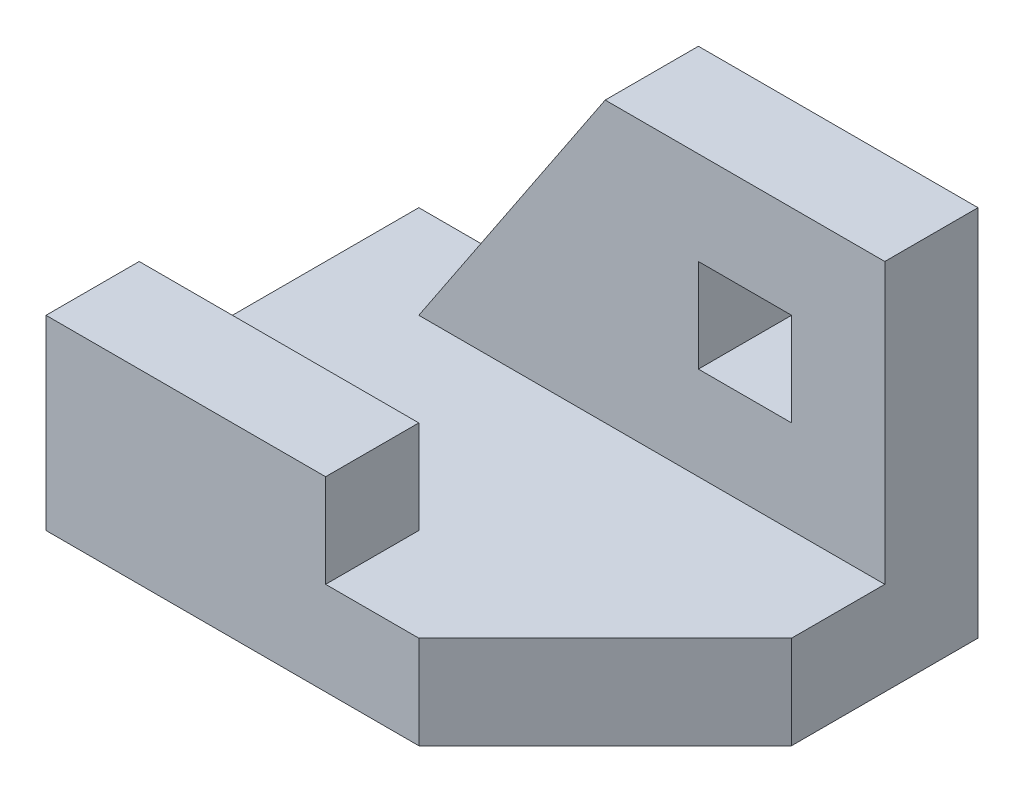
ISO-10303-21;
HEADER;
FILE_DESCRIPTION(('STEP AP214'),'2;1');
FILE_NAME('part.step','',(''),(''),'','','');
FILE_SCHEMA(('AUTOMOTIVE_DESIGN { 1 0 10303 214 1 1 1 1 }'));
ENDSEC;
DATA;
#1=APPLICATION_CONTEXT('core data for automotive mechanical design processes');
#2=APPLICATION_PROTOCOL_DEFINITION('international standard','automotive_design',2000,#1);
#3=PRODUCT_CONTEXT('',#1,'mechanical');
#4=PRODUCT('Part','Part','',(#3));
#5=PRODUCT_RELATED_PRODUCT_CATEGORY('part','',(#4));
#6=PRODUCT_DEFINITION_FORMATION('','',#4);
#7=PRODUCT_DEFINITION_CONTEXT('part definition',#1,'design');
#8=PRODUCT_DEFINITION('design','',#6,#7);
#9=PRODUCT_DEFINITION_SHAPE('','',#8);
#10=(LENGTH_UNIT() NAMED_UNIT(*) SI_UNIT(.MILLI.,.METRE.));
#11=(NAMED_UNIT(*) PLANE_ANGLE_UNIT() SI_UNIT($,.RADIAN.));
#12=(NAMED_UNIT(*) SI_UNIT($,.STERADIAN.) SOLID_ANGLE_UNIT());
#13=UNCERTAINTY_MEASURE_WITH_UNIT(LENGTH_MEASURE(1.E-05),#10,'distance_accuracy_value','');
#14=(GEOMETRIC_REPRESENTATION_CONTEXT(3) GLOBAL_UNCERTAINTY_ASSIGNED_CONTEXT((#13)) GLOBAL_UNIT_ASSIGNED_CONTEXT((#10,
#11,#12)) REPRESENTATION_CONTEXT('',''));
#15=CARTESIAN_POINT('',(0.,0.,0.));
#16=DIRECTION('',(0.,0.,1.));
#17=DIRECTION('',(1.,0.,0.));
#18=AXIS2_PLACEMENT_3D('',#15,#16,#17);
#19=CARTESIAN_POINT('',(-30.,10.,-20.));
#20=DIRECTION('',(0.,-1.,0.));
#21=DIRECTION('',(0.,0.,-1.));
#22=AXIS2_PLACEMENT_3D('',#19,#20,#21);
#23=PLANE('',#22);
#24=DIRECTION('',(-1.,0.,0.));
#25=VECTOR('',#24,1.);
#26=CARTESIAN_POINT('',(-20.,10.,-10.));
#27=LINE('',#26,#25);
#28=CARTESIAN_POINT('',(30.,10.,-10.));
#29=VERTEX_POINT('',#28);
#30=CARTESIAN_POINT('',(-20.,10.,-10.));
#31=VERTEX_POINT('',#30);
#32=EDGE_CURVE('E48',#29,#31,#27,.T.);
#33=ORIENTED_EDGE('',*,*,#32,.T.);
#34=DIRECTION('',(0.,0.,-1.));
#35=VECTOR('',#34,1.);
#36=CARTESIAN_POINT('',(-20.,10.,-10.));
#37=LINE('',#36,#35);
#38=CARTESIAN_POINT('',(-20.,10.,-20.));
#39=VERTEX_POINT('',#38);
#40=EDGE_CURVE('E193',#31,#39,#37,.T.);
#41=ORIENTED_EDGE('',*,*,#40,.T.);
#42=DIRECTION('',(-1.,0.,0.));
#43=VECTOR('',#42,1.);
#44=CARTESIAN_POINT('',(-30.,10.,-20.));
#45=LINE('',#44,#43);
#46=CARTESIAN_POINT('',(-30.,10.,-20.));
#47=VERTEX_POINT('',#46);
#48=EDGE_CURVE('E257',#39,#47,#45,.T.);
#49=ORIENTED_EDGE('',*,*,#48,.T.);
#50=DIRECTION('',(0.,0.,1.));
#51=VECTOR('',#50,1.);
#52=CARTESIAN_POINT('',(-30.,10.,20.));
#53=LINE('',#52,#51);
#54=CARTESIAN_POINT('',(-30.,10.,10.));
#55=VERTEX_POINT('',#54);
#56=EDGE_CURVE('E248',#47,#55,#53,.T.);
#57=ORIENTED_EDGE('',*,*,#56,.T.);
#58=DIRECTION('',(-1.,0.,0.));
#59=VECTOR('',#58,1.);
#60=CARTESIAN_POINT('',(-30.,10.,10.));
#61=LINE('',#60,#59);
#62=CARTESIAN_POINT('',(0.,10.,10.));
#63=VERTEX_POINT('',#62);
#64=EDGE_CURVE('E209',#63,#55,#61,.T.);
#65=ORIENTED_EDGE('',*,*,#64,.F.);
#66=DIRECTION('',(0.,0.,-1.));
#67=VECTOR('',#66,1.);
#68=CARTESIAN_POINT('',(0.,10.,20.));
#69=LINE('',#68,#67);
#70=CARTESIAN_POINT('',(0.,10.,20.));
#71=VERTEX_POINT('',#70);
#72=EDGE_CURVE('E201',#71,#63,#69,.T.);
#73=ORIENTED_EDGE('',*,*,#72,.F.);
#74=DIRECTION('',(1.,0.,0.));
#75=VECTOR('',#74,1.);
#76=CARTESIAN_POINT('',(-30.,10.,20.));
#77=LINE('',#76,#75);
#78=CARTESIAN_POINT('',(9.99999999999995,10.,20.));
#79=VERTEX_POINT('',#78);
#80=EDGE_CURVE('E250',#71,#79,#77,.T.);
#81=ORIENTED_EDGE('',*,*,#80,.T.);
#82=DIRECTION('',(-0.707106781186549,0.,0.707106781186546));
#83=VECTOR('',#82,1.);
#84=CARTESIAN_POINT('',(30.,10.,0.));
#85=LINE('',#84,#83);
#86=CARTESIAN_POINT('',(30.,10.,0.));
#87=VERTEX_POINT('',#86);
#88=EDGE_CURVE('E11',#79,#87,#85,.F.);
#89=ORIENTED_EDGE('',*,*,#88,.T.);
#90=DIRECTION('',(0.,0.,-1.));
#91=VECTOR('',#90,1.);
#92=CARTESIAN_POINT('',(30.,10.,20.));
#93=LINE('',#92,#91);
#94=EDGE_CURVE('E52',#87,#29,#93,.T.);
#95=ORIENTED_EDGE('',*,*,#94,.T.);
#96=EDGE_LOOP('',(#33,#41,#49,#57,#65,#73,#81,#89,#95));
#97=FACE_BOUND('',#96,.T.);
#98=ADVANCED_FACE('F31',(#97),#23,.F.);
#99=CARTESIAN_POINT('',(-30.,10.,20.));
#100=DIRECTION('',(1.,0.,0.));
#101=DIRECTION('',(0.,0.,-1.));
#102=AXIS2_PLACEMENT_3D('',#99,#100,#101);
#103=PLANE('',#102);
#104=DIRECTION('',(0.,0.,1.));
#105=VECTOR('',#104,1.);
#106=CARTESIAN_POINT('',(-30.,0.,20.));
#107=LINE('',#106,#105);
#108=CARTESIAN_POINT('',(-30.,0.,-20.));
#109=VERTEX_POINT('',#108);
#110=CARTESIAN_POINT('',(-30.,0.,20.));
#111=VERTEX_POINT('',#110);
#112=EDGE_CURVE('E236',#109,#111,#107,.T.);
#113=ORIENTED_EDGE('',*,*,#112,.T.);
#114=DIRECTION('',(0.,-1.,0.));
#115=VECTOR('',#114,1.);
#116=CARTESIAN_POINT('',(-30.,10.,20.));
#117=LINE('',#116,#115);
#118=CARTESIAN_POINT('',(-30.,20.,20.));
#119=VERTEX_POINT('',#118);
#120=EDGE_CURVE('E270',#119,#111,#117,.T.);
#121=ORIENTED_EDGE('',*,*,#120,.F.);
#122=DIRECTION('',(0.,0.,1.));
#123=VECTOR('',#122,1.);
#124=CARTESIAN_POINT('',(-30.,20.,20.));
#125=LINE('',#124,#123);
#126=CARTESIAN_POINT('',(-30.,20.,10.));
#127=VERTEX_POINT('',#126);
#128=EDGE_CURVE('E205',#127,#119,#125,.T.);
#129=ORIENTED_EDGE('',*,*,#128,.F.);
#130=DIRECTION('',(0.,-1.,0.));
#131=VECTOR('',#130,1.);
#132=CARTESIAN_POINT('',(-30.,20.,10.));
#133=LINE('',#132,#131);
#134=EDGE_CURVE('E215',#127,#55,#133,.T.);
#135=ORIENTED_EDGE('',*,*,#134,.T.);
#136=ORIENTED_EDGE('',*,*,#56,.F.);
#137=DIRECTION('',(0.,-1.,0.));
#138=VECTOR('',#137,1.);
#139=CARTESIAN_POINT('',(-30.,10.,-20.));
#140=LINE('',#139,#138);
#141=EDGE_CURVE('E258',#47,#109,#140,.T.);
#142=ORIENTED_EDGE('',*,*,#141,.T.);
#143=EDGE_LOOP('',(#113,#121,#129,#135,#136,#142));
#144=FACE_BOUND('',#143,.T.);
#145=ADVANCED_FACE('F302',(#144),#103,.F.);
#146=CARTESIAN_POINT('',(-30.,10.,20.));
#147=DIRECTION('',(0.,0.,-1.));
#148=DIRECTION('',(-1.,0.,0.));
#149=AXIS2_PLACEMENT_3D('',#146,#147,#148);
#150=PLANE('',#149);
#151=DIRECTION('',(1.,0.,0.));
#152=VECTOR('',#151,1.);
#153=CARTESIAN_POINT('',(-30.,0.,20.));
#154=LINE('',#153,#152);
#155=CARTESIAN_POINT('',(9.99999999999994,0.,20.));
#156=VERTEX_POINT('',#155);
#157=EDGE_CURVE('E242',#111,#156,#154,.T.);
#158=ORIENTED_EDGE('',*,*,#157,.T.);
#159=DIRECTION('',(0.,1.,0.));
#160=VECTOR('',#159,1.);
#161=CARTESIAN_POINT('',(9.99999999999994,10.,20.));
#162=LINE('',#161,#160);
#163=EDGE_CURVE('E40',#156,#79,#162,.T.);
#164=ORIENTED_EDGE('',*,*,#163,.T.);
#165=ORIENTED_EDGE('',*,*,#80,.F.);
#166=DIRECTION('',(0.,-1.,0.));
#167=VECTOR('',#166,1.);
#168=CARTESIAN_POINT('',(0.,20.,20.));
#169=LINE('',#168,#167);
#170=CARTESIAN_POINT('',(0.,20.,20.));
#171=VERTEX_POINT('',#170);
#172=EDGE_CURVE('E231',#171,#71,#169,.T.);
#173=ORIENTED_EDGE('',*,*,#172,.F.);
#174=DIRECTION('',(1.,0.,0.));
#175=VECTOR('',#174,1.);
#176=CARTESIAN_POINT('',(-30.,20.,20.));
#177=LINE('',#176,#175);
#178=EDGE_CURVE('E208',#119,#171,#177,.T.);
#179=ORIENTED_EDGE('',*,*,#178,.F.);
#180=ORIENTED_EDGE('',*,*,#120,.T.);
#181=EDGE_LOOP('',(#158,#164,#165,#173,#179,#180));
#182=FACE_BOUND('',#181,.T.);
#183=ADVANCED_FACE('F283',(#182),#150,.F.);
#184=CARTESIAN_POINT('',(30.,10.,20.));
#185=DIRECTION('',(-1.,0.,0.));
#186=DIRECTION('',(0.,0.,1.));
#187=AXIS2_PLACEMENT_3D('',#184,#185,#186);
#188=PLANE('',#187);
#189=ORIENTED_EDGE('',*,*,#94,.F.);
#190=DIRECTION('',(0.,-1.,0.));
#191=VECTOR('',#190,1.);
#192=CARTESIAN_POINT('',(30.,10.,0.));
#193=LINE('',#192,#191);
#194=CARTESIAN_POINT('',(30.,0.,0.));
#195=VERTEX_POINT('',#194);
#196=EDGE_CURVE('E273',#87,#195,#193,.T.);
#197=ORIENTED_EDGE('',*,*,#196,.T.);
#198=DIRECTION('',(0.,0.,-1.));
#199=VECTOR('',#198,1.);
#200=CARTESIAN_POINT('',(30.,0.,20.));
#201=LINE('',#200,#199);
#202=CARTESIAN_POINT('',(30.,0.,-20.));
#203=VERTEX_POINT('',#202);
#204=EDGE_CURVE('E262',#195,#203,#201,.T.);
#205=ORIENTED_EDGE('',*,*,#204,.T.);
#206=DIRECTION('',(0.,-1.,0.));
#207=VECTOR('',#206,1.);
#208=CARTESIAN_POINT('',(30.,10.,-20.));
#209=LINE('',#208,#207);
#210=CARTESIAN_POINT('',(30.,40.,-20.));
#211=VERTEX_POINT('',#210);
#212=EDGE_CURVE('E267',#211,#203,#209,.T.);
#213=ORIENTED_EDGE('',*,*,#212,.F.);
#214=DIRECTION('',(0.,0.,-1.));
#215=VECTOR('',#214,1.);
#216=CARTESIAN_POINT('',(30.,40.,-10.));
#217=LINE('',#216,#215);
#218=CARTESIAN_POINT('',(30.,40.,-10.));
#219=VERTEX_POINT('',#218);
#220=EDGE_CURVE('E198',#219,#211,#217,.T.);
#221=ORIENTED_EDGE('',*,*,#220,.F.);
#222=DIRECTION('',(0.,-1.,0.));
#223=VECTOR('',#222,1.);
#224=CARTESIAN_POINT('',(30.,10.,-10.));
#225=LINE('',#224,#223);
#226=EDGE_CURVE('E190',#219,#29,#225,.T.);
#227=ORIENTED_EDGE('',*,*,#226,.T.);
#228=EDGE_LOOP('',(#189,#197,#205,#213,#221,#227));
#229=FACE_BOUND('',#228,.T.);
#230=ADVANCED_FACE('F287',(#229),#188,.F.);
#231=CARTESIAN_POINT('',(-30.,10.,-20.));
#232=DIRECTION('',(0.,0.,1.));
#233=DIRECTION('',(1.,0.,0.));
#234=AXIS2_PLACEMENT_3D('',#231,#232,#233);
#235=PLANE('',#234);
#236=DIRECTION('',(-1.,0.,0.));
#237=VECTOR('',#236,1.);
#238=CARTESIAN_POINT('',(-30.,0.,-20.));
#239=LINE('',#238,#237);
#240=EDGE_CURVE('E251',#203,#109,#239,.T.);
#241=ORIENTED_EDGE('',*,*,#240,.T.);
#242=ORIENTED_EDGE('',*,*,#141,.F.);
#243=ORIENTED_EDGE('',*,*,#48,.F.);
#244=DIRECTION('',(0.554700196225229,0.832050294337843,0.));
#245=VECTOR('',#244,1.);
#246=CARTESIAN_POINT('',(0.,40.,-20.));
#247=LINE('',#246,#245);
#248=CARTESIAN_POINT('',(0.,40.,-20.));
#249=VERTEX_POINT('',#248);
#250=EDGE_CURVE('E178',#39,#249,#247,.T.);
#251=ORIENTED_EDGE('',*,*,#250,.T.);
#252=DIRECTION('',(1.,0.,0.));
#253=VECTOR('',#252,1.);
#254=CARTESIAN_POINT('',(30.,40.,-20.));
#255=LINE('',#254,#253);
#256=EDGE_CURVE('E184',#249,#211,#255,.T.);
#257=ORIENTED_EDGE('',*,*,#256,.T.);
#258=ORIENTED_EDGE('',*,*,#212,.T.);
#259=EDGE_LOOP('',(#241,#242,#243,#251,#257,#258));
#260=FACE_BOUND('',#259,.T.);
#261=DIRECTION('',(-1.,0.,0.));
#262=VECTOR('',#261,1.);
#263=CARTESIAN_POINT('',(20.,20.,-20.));
#264=LINE('',#263,#262);
#265=CARTESIAN_POINT('',(20.,20.,-20.));
#266=VERTEX_POINT('',#265);
#267=CARTESIAN_POINT('',(10.,20.,-20.));
#268=VERTEX_POINT('',#267);
#269=EDGE_CURVE('E172',#266,#268,#264,.T.);
#270=ORIENTED_EDGE('',*,*,#269,.F.);
#271=DIRECTION('',(0.,-1.,0.));
#272=VECTOR('',#271,1.);
#273=CARTESIAN_POINT('',(20.,30.,-20.));
#274=LINE('',#273,#272);
#275=CARTESIAN_POINT('',(20.,30.,-20.));
#276=VERTEX_POINT('',#275);
#277=EDGE_CURVE('E145',#276,#266,#274,.T.);
#278=ORIENTED_EDGE('',*,*,#277,.F.);
#279=DIRECTION('',(1.,0.,0.));
#280=VECTOR('',#279,1.);
#281=CARTESIAN_POINT('',(20.,30.,-20.));
#282=LINE('',#281,#280);
#283=CARTESIAN_POINT('',(10.,30.,-20.));
#284=VERTEX_POINT('',#283);
#285=EDGE_CURVE('E163',#284,#276,#282,.T.);
#286=ORIENTED_EDGE('',*,*,#285,.F.);
#287=DIRECTION('',(0.,1.,0.));
#288=VECTOR('',#287,1.);
#289=CARTESIAN_POINT('',(10.,30.,-20.));
#290=LINE('',#289,#288);
#291=EDGE_CURVE('E166',#268,#284,#290,.T.);
#292=ORIENTED_EDGE('',*,*,#291,.F.);
#293=EDGE_LOOP('',(#270,#278,#286,#292));
#294=FACE_BOUND('',#293,.T.);
#295=ADVANCED_FACE('F298',(#260,#294),#235,.F.);
#296=CARTESIAN_POINT('',(-30.,0.,-20.));
#297=DIRECTION('',(0.,-1.,0.));
#298=DIRECTION('',(0.,0.,-1.));
#299=AXIS2_PLACEMENT_3D('',#296,#297,#298);
#300=PLANE('',#299);
#301=ORIENTED_EDGE('',*,*,#204,.F.);
#302=DIRECTION('',(0.707106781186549,0.,-0.707106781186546));
#303=VECTOR('',#302,1.);
#304=CARTESIAN_POINT('',(9.99999999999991,0.,20.));
#305=LINE('',#304,#303);
#306=EDGE_CURVE('E276',#195,#156,#305,.F.);
#307=ORIENTED_EDGE('',*,*,#306,.T.);
#308=ORIENTED_EDGE('',*,*,#157,.F.);
#309=ORIENTED_EDGE('',*,*,#112,.F.);
#310=ORIENTED_EDGE('',*,*,#240,.F.);
#311=EDGE_LOOP('',(#301,#307,#308,#309,#310));
#312=FACE_BOUND('',#311,.T.);
#313=ADVANCED_FACE('F315',(#312),#300,.T.);
#314=CARTESIAN_POINT('',(30.,10.,0.));
#315=DIRECTION('',(-0.707106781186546,0.,-0.707106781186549));
#316=DIRECTION('',(-0.707106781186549,0.,0.707106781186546));
#317=AXIS2_PLACEMENT_3D('',#314,#315,#316);
#318=PLANE('',#317);
#319=ORIENTED_EDGE('',*,*,#88,.F.);
#320=ORIENTED_EDGE('',*,*,#163,.F.);
#321=ORIENTED_EDGE('',*,*,#306,.F.);
#322=ORIENTED_EDGE('',*,*,#196,.F.);
#323=EDGE_LOOP('',(#319,#320,#321,#322));
#324=FACE_BOUND('',#323,.T.);
#325=ADVANCED_FACE('F33',(#324),#318,.F.);
#326=CARTESIAN_POINT('',(0.,20.,20.));
#327=DIRECTION('',(-1.,0.,0.));
#328=DIRECTION('',(0.,0.,1.));
#329=AXIS2_PLACEMENT_3D('',#326,#327,#328);
#330=PLANE('',#329);
#331=ORIENTED_EDGE('',*,*,#72,.T.);
#332=DIRECTION('',(0.,-1.,0.));
#333=VECTOR('',#332,1.);
#334=CARTESIAN_POINT('',(0.,20.,10.));
#335=LINE('',#334,#333);
#336=CARTESIAN_POINT('',(0.,20.,10.));
#337=VERTEX_POINT('',#336);
#338=EDGE_CURVE('E218',#337,#63,#335,.T.);
#339=ORIENTED_EDGE('',*,*,#338,.F.);
#340=DIRECTION('',(0.,0.,-1.));
#341=VECTOR('',#340,1.);
#342=CARTESIAN_POINT('',(0.,20.,20.));
#343=LINE('',#342,#341);
#344=EDGE_CURVE('E211',#171,#337,#343,.T.);
#345=ORIENTED_EDGE('',*,*,#344,.F.);
#346=ORIENTED_EDGE('',*,*,#172,.T.);
#347=EDGE_LOOP('',(#331,#339,#345,#346));
#348=FACE_BOUND('',#347,.T.);
#349=ADVANCED_FACE('F319',(#348),#330,.F.);
#350=CARTESIAN_POINT('',(-30.,20.,10.));
#351=DIRECTION('',(0.,0.,1.));
#352=DIRECTION('',(1.,0.,0.));
#353=AXIS2_PLACEMENT_3D('',#350,#351,#352);
#354=PLANE('',#353);
#355=ORIENTED_EDGE('',*,*,#64,.T.);
#356=ORIENTED_EDGE('',*,*,#134,.F.);
#357=DIRECTION('',(-1.,0.,0.));
#358=VECTOR('',#357,1.);
#359=CARTESIAN_POINT('',(-30.,20.,10.));
#360=LINE('',#359,#358);
#361=EDGE_CURVE('E213',#337,#127,#360,.T.);
#362=ORIENTED_EDGE('',*,*,#361,.F.);
#363=ORIENTED_EDGE('',*,*,#338,.T.);
#364=EDGE_LOOP('',(#355,#356,#362,#363));
#365=FACE_BOUND('',#364,.T.);
#366=ADVANCED_FACE('F322',(#365),#354,.F.);
#367=CARTESIAN_POINT('',(-30.,20.,10.));
#368=DIRECTION('',(0.,-1.,0.));
#369=DIRECTION('',(0.,0.,-1.));
#370=AXIS2_PLACEMENT_3D('',#367,#368,#369);
#371=PLANE('',#370);
#372=ORIENTED_EDGE('',*,*,#128,.T.);
#373=ORIENTED_EDGE('',*,*,#178,.T.);
#374=ORIENTED_EDGE('',*,*,#344,.T.);
#375=ORIENTED_EDGE('',*,*,#361,.T.);
#376=EDGE_LOOP('',(#372,#373,#374,#375));
#377=FACE_BOUND('',#376,.T.);
#378=ADVANCED_FACE('F325',(#377),#371,.F.);
#379=CARTESIAN_POINT('',(30.,40.,-10.));
#380=DIRECTION('',(0.,1.,0.));
#381=DIRECTION('',(0.,0.,1.));
#382=AXIS2_PLACEMENT_3D('',#379,#380,#381);
#383=PLANE('',#382);
#384=ORIENTED_EDGE('',*,*,#256,.F.);
#385=DIRECTION('',(0.,0.,-1.));
#386=VECTOR('',#385,1.);
#387=CARTESIAN_POINT('',(0.,40.,-10.));
#388=LINE('',#387,#386);
#389=CARTESIAN_POINT('',(0.,40.,-10.));
#390=VERTEX_POINT('',#389);
#391=EDGE_CURVE('E202',#390,#249,#388,.T.);
#392=ORIENTED_EDGE('',*,*,#391,.F.);
#393=DIRECTION('',(1.,0.,0.));
#394=VECTOR('',#393,1.);
#395=CARTESIAN_POINT('',(30.,40.,-10.));
#396=LINE('',#395,#394);
#397=EDGE_CURVE('E187',#390,#219,#396,.T.);
#398=ORIENTED_EDGE('',*,*,#397,.T.);
#399=ORIENTED_EDGE('',*,*,#220,.T.);
#400=EDGE_LOOP('',(#384,#392,#398,#399));
#401=FACE_BOUND('',#400,.T.);
#402=ADVANCED_FACE('F328',(#401),#383,.T.);
#403=CARTESIAN_POINT('',(0.,40.,-10.));
#404=DIRECTION('',(-0.832050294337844,0.554700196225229,0.));
#405=DIRECTION('',(-0.554700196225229,-0.832050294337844,0.));
#406=AXIS2_PLACEMENT_3D('',#403,#404,#405);
#407=PLANE('',#406);
#408=ORIENTED_EDGE('',*,*,#250,.F.);
#409=ORIENTED_EDGE('',*,*,#40,.F.);
#410=DIRECTION('',(0.554700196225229,0.832050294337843,0.));
#411=VECTOR('',#410,1.);
#412=CARTESIAN_POINT('',(0.,40.,-10.));
#413=LINE('',#412,#411);
#414=EDGE_CURVE('E183',#31,#390,#413,.T.);
#415=ORIENTED_EDGE('',*,*,#414,.T.);
#416=ORIENTED_EDGE('',*,*,#391,.T.);
#417=EDGE_LOOP('',(#408,#409,#415,#416));
#418=FACE_BOUND('',#417,.T.);
#419=ADVANCED_FACE('F294',(#418),#407,.T.);
#420=CARTESIAN_POINT('',(30.,10.,-10.));
#421=DIRECTION('',(0.,0.,1.));
#422=DIRECTION('',(1.,0.,0.));
#423=AXIS2_PLACEMENT_3D('',#420,#421,#422);
#424=PLANE('',#423);
#425=DIRECTION('',(0.,-1.,0.));
#426=VECTOR('',#425,1.);
#427=CARTESIAN_POINT('',(20.,30.,-10.));
#428=LINE('',#427,#426);
#429=CARTESIAN_POINT('',(20.,30.,-10.));
#430=VERTEX_POINT('',#429);
#431=CARTESIAN_POINT('',(20.,20.,-10.));
#432=VERTEX_POINT('',#431);
#433=EDGE_CURVE('E142',#430,#432,#428,.T.);
#434=ORIENTED_EDGE('',*,*,#433,.T.);
#435=DIRECTION('',(-1.,0.,0.));
#436=VECTOR('',#435,1.);
#437=CARTESIAN_POINT('',(20.,20.,-10.));
#438=LINE('',#437,#436);
#439=CARTESIAN_POINT('',(10.,20.,-10.));
#440=VERTEX_POINT('',#439);
#441=EDGE_CURVE('E154',#432,#440,#438,.T.);
#442=ORIENTED_EDGE('',*,*,#441,.T.);
#443=DIRECTION('',(0.,1.,0.));
#444=VECTOR('',#443,1.);
#445=CARTESIAN_POINT('',(10.,30.,-10.));
#446=LINE('',#445,#444);
#447=CARTESIAN_POINT('',(10.,30.,-10.));
#448=VERTEX_POINT('',#447);
#449=EDGE_CURVE('E158',#440,#448,#446,.T.);
#450=ORIENTED_EDGE('',*,*,#449,.T.);
#451=DIRECTION('',(1.,0.,0.));
#452=VECTOR('',#451,1.);
#453=CARTESIAN_POINT('',(20.,30.,-10.));
#454=LINE('',#453,#452);
#455=EDGE_CURVE('E150',#448,#430,#454,.T.);
#456=ORIENTED_EDGE('',*,*,#455,.T.);
#457=EDGE_LOOP('',(#434,#442,#450,#456));
#458=FACE_BOUND('',#457,.T.);
#459=ORIENTED_EDGE('',*,*,#32,.F.);
#460=ORIENTED_EDGE('',*,*,#226,.F.);
#461=ORIENTED_EDGE('',*,*,#397,.F.);
#462=ORIENTED_EDGE('',*,*,#414,.F.);
#463=EDGE_LOOP('',(#459,#460,#461,#462));
#464=FACE_BOUND('',#463,.T.);
#465=ADVANCED_FACE('F160',(#458,#464),#424,.T.);
#466=CARTESIAN_POINT('',(20.,30.,-10.));
#467=DIRECTION('',(1.,0.,0.));
#468=DIRECTION('',(0.,1.,0.));
#469=AXIS2_PLACEMENT_3D('',#466,#467,#468);
#470=PLANE('',#469);
#471=ORIENTED_EDGE('',*,*,#277,.T.);
#472=DIRECTION('',(0.,0.,-1.));
#473=VECTOR('',#472,1.);
#474=CARTESIAN_POINT('',(20.,20.,-10.));
#475=LINE('',#474,#473);
#476=EDGE_CURVE('E138',#432,#266,#475,.T.);
#477=ORIENTED_EDGE('',*,*,#476,.F.);
#478=ORIENTED_EDGE('',*,*,#433,.F.);
#479=DIRECTION('',(0.,0.,-1.));
#480=VECTOR('',#479,1.);
#481=CARTESIAN_POINT('',(20.,30.,-10.));
#482=LINE('',#481,#480);
#483=EDGE_CURVE('E176',#430,#276,#482,.T.);
#484=ORIENTED_EDGE('',*,*,#483,.T.);
#485=EDGE_LOOP('',(#471,#477,#478,#484));
#486=FACE_BOUND('',#485,.T.);
#487=ADVANCED_FACE('F140',(#486),#470,.F.);
#488=CARTESIAN_POINT('',(20.,30.,-10.));
#489=DIRECTION('',(0.,1.,0.));
#490=DIRECTION('',(-1.,0.,0.));
#491=AXIS2_PLACEMENT_3D('',#488,#489,#490);
#492=PLANE('',#491);
#493=ORIENTED_EDGE('',*,*,#285,.T.);
#494=ORIENTED_EDGE('',*,*,#483,.F.);
#495=ORIENTED_EDGE('',*,*,#455,.F.);
#496=DIRECTION('',(0.,0.,-1.));
#497=VECTOR('',#496,1.);
#498=CARTESIAN_POINT('',(10.,30.,-10.));
#499=LINE('',#498,#497);
#500=EDGE_CURVE('E179',#448,#284,#499,.T.);
#501=ORIENTED_EDGE('',*,*,#500,.T.);
#502=EDGE_LOOP('',(#493,#494,#495,#501));
#503=FACE_BOUND('',#502,.T.);
#504=ADVANCED_FACE('F339',(#503),#492,.F.);
#505=CARTESIAN_POINT('',(10.,30.,-10.));
#506=DIRECTION('',(-1.,0.,0.));
#507=DIRECTION('',(0.,0.,1.));
#508=AXIS2_PLACEMENT_3D('',#505,#506,#507);
#509=PLANE('',#508);
#510=ORIENTED_EDGE('',*,*,#291,.T.);
#511=ORIENTED_EDGE('',*,*,#500,.F.);
#512=ORIENTED_EDGE('',*,*,#449,.F.);
#513=DIRECTION('',(0.,0.,-1.));
#514=VECTOR('',#513,1.);
#515=CARTESIAN_POINT('',(10.,20.,-10.));
#516=LINE('',#515,#514);
#517=EDGE_CURVE('E149',#440,#268,#516,.T.);
#518=ORIENTED_EDGE('',*,*,#517,.T.);
#519=EDGE_LOOP('',(#510,#511,#512,#518));
#520=FACE_BOUND('',#519,.T.);
#521=ADVANCED_FACE('F342',(#520),#509,.F.);
#522=CARTESIAN_POINT('',(20.,20.,-10.));
#523=DIRECTION('',(0.,-1.,0.));
#524=DIRECTION('',(0.,0.,-1.));
#525=AXIS2_PLACEMENT_3D('',#522,#523,#524);
#526=PLANE('',#525);
#527=ORIENTED_EDGE('',*,*,#269,.T.);
#528=ORIENTED_EDGE('',*,*,#517,.F.);
#529=ORIENTED_EDGE('',*,*,#441,.F.);
#530=ORIENTED_EDGE('',*,*,#476,.T.);
#531=EDGE_LOOP('',(#527,#528,#529,#530));
#532=FACE_BOUND('',#531,.T.);
#533=ADVANCED_FACE('F155',(#532),#526,.F.);
#534=CLOSED_SHELL('',(#98,#145,#183,#230,#295,#313,#325,#349,#366,#378,#402,#419,#465,#487,#504,
#521,#533));
#535=MANIFOLD_SOLID_BREP('B2',#534);
#536=ADVANCED_BREP_SHAPE_REPRESENTATION('',(#18,#535),#14);
#537=SHAPE_DEFINITION_REPRESENTATION(#9,#536);
ENDSEC;
END-ISO-10303-21;
